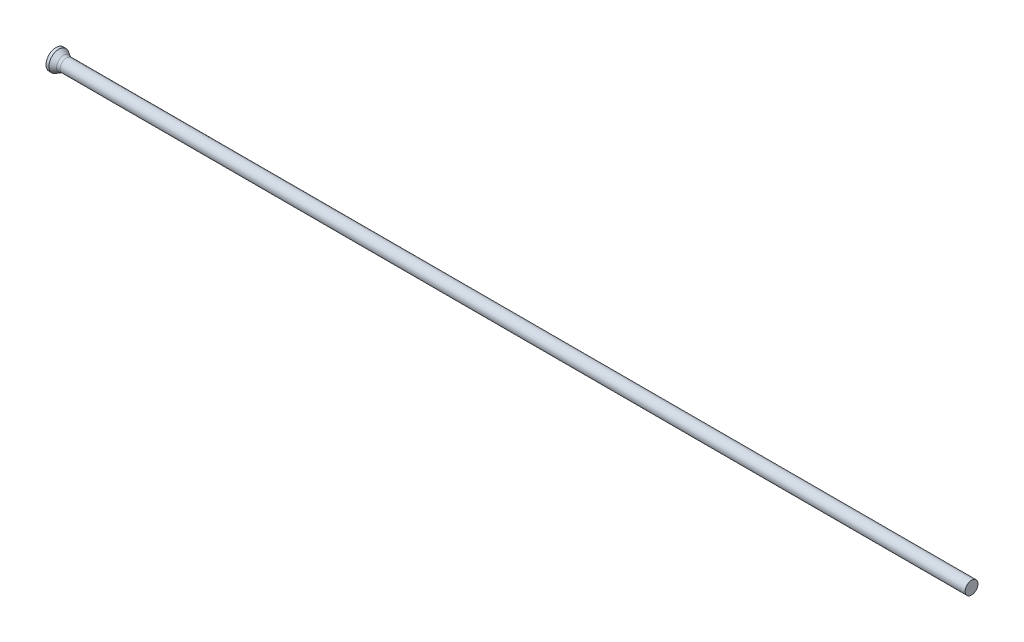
ISO-10303-21;
HEADER;
FILE_DESCRIPTION(('STEP AP214'),'2;1');
FILE_NAME('part.step','',(''),(''),'','','');
FILE_SCHEMA(('AUTOMOTIVE_DESIGN { 1 0 10303 214 1 1 1 1 }'));
ENDSEC;
DATA;
#1=APPLICATION_CONTEXT('core data for automotive mechanical design processes');
#2=APPLICATION_PROTOCOL_DEFINITION('international standard','automotive_design',2000,#1);
#3=PRODUCT_CONTEXT('',#1,'mechanical');
#4=PRODUCT('Part','Part','',(#3));
#5=PRODUCT_RELATED_PRODUCT_CATEGORY('part','',(#4));
#6=PRODUCT_DEFINITION_FORMATION('','',#4);
#7=PRODUCT_DEFINITION_CONTEXT('part definition',#1,'design');
#8=PRODUCT_DEFINITION('design','',#6,#7);
#9=PRODUCT_DEFINITION_SHAPE('','',#8);
#10=(LENGTH_UNIT() NAMED_UNIT(*) SI_UNIT(.MILLI.,.METRE.));
#11=(NAMED_UNIT(*) PLANE_ANGLE_UNIT() SI_UNIT($,.RADIAN.));
#12=(NAMED_UNIT(*) SI_UNIT($,.STERADIAN.) SOLID_ANGLE_UNIT());
#13=UNCERTAINTY_MEASURE_WITH_UNIT(LENGTH_MEASURE(1.E-05),#10,'distance_accuracy_value','');
#14=(GEOMETRIC_REPRESENTATION_CONTEXT(3) GLOBAL_UNCERTAINTY_ASSIGNED_CONTEXT((#13)) GLOBAL_UNIT_ASSIGNED_CONTEXT((#10,
#11,#12)) REPRESENTATION_CONTEXT('',''));
#15=CARTESIAN_POINT('',(0.,0.,0.));
#16=DIRECTION('',(0.,0.,1.));
#17=DIRECTION('',(1.,0.,0.));
#18=AXIS2_PLACEMENT_3D('',#15,#16,#17);
#19=CARTESIAN_POINT('',(0.,0.,0.));
#20=DIRECTION('',(1.,0.,0.));
#21=DIRECTION('',(0.,0.,-1.));
#22=AXIS2_PLACEMENT_3D('',#19,#20,#21);
#23=PLANE('',#22);
#24=CARTESIAN_POINT('',(0.,0.,0.));
#25=DIRECTION('',(-1.,0.,0.));
#26=DIRECTION('',(0.,0.,1.));
#27=AXIS2_PLACEMENT_3D('',#24,#25,#26);
#28=CIRCLE('',#27,1.75);
#29=CARTESIAN_POINT('',(0.,0.,1.75));
#30=VERTEX_POINT('',#29);
#31=EDGE_CURVE('E25',#30,#30,#28,.T.);
#32=ORIENTED_EDGE('',*,*,#31,.T.);
#33=EDGE_LOOP('',(#32));
#34=FACE_BOUND('',#33,.T.);
#35=ADVANCED_FACE('F14',(#34),#23,.F.);
#36=CARTESIAN_POINT('',(0.,0.,0.));
#37=DIRECTION('',(-1.,0.,0.));
#38=DIRECTION('',(0.,0.,1.));
#39=AXIS2_PLACEMENT_3D('',#36,#37,#38);
#40=CYLINDRICAL_SURFACE('',#39,1.75);
#41=ORIENTED_EDGE('',*,*,#31,.F.);
#42=EDGE_LOOP('',(#41));
#43=FACE_BOUND('',#42,.T.);
#44=CARTESIAN_POINT('',(0.507468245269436,0.,0.));
#45=DIRECTION('',(-1.,0.,0.));
#46=DIRECTION('',(0.,0.,1.));
#47=AXIS2_PLACEMENT_3D('',#44,#45,#46);
#48=CIRCLE('',#47,1.75);
#49=CARTESIAN_POINT('',(0.507468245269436,0.,1.75));
#50=VERTEX_POINT('',#49);
#51=EDGE_CURVE('E29',#50,#50,#48,.T.);
#52=ORIENTED_EDGE('',*,*,#51,.T.);
#53=EDGE_LOOP('',(#52));
#54=FACE_BOUND('',#53,.T.);
#55=ADVANCED_FACE('F53',(#43,#54),#40,.T.);
#56=CARTESIAN_POINT('',(1.59,0.,0.));
#57=DIRECTION('',(-1.,0.,0.));
#58=DIRECTION('',(0.,0.,1.));
#59=AXIS2_PLACEMENT_3D('',#56,#57,#58);
#60=CONICAL_SURFACE('',#59,1.125,0.523598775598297);
#61=CARTESIAN_POINT('',(1.35794919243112,0.,0.));
#62=DIRECTION('',(-1.,0.,0.));
#63=DIRECTION('',(0.,0.,1.));
#64=AXIS2_PLACEMENT_3D('',#61,#62,#63);
#65=CIRCLE('',#64,1.25897459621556);
#66=CARTESIAN_POINT('',(1.35794919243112,0.,1.25897459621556));
#67=VERTEX_POINT('',#66);
#68=EDGE_CURVE('E21',#67,#67,#65,.T.);
#69=ORIENTED_EDGE('',*,*,#68,.T.);
#70=EDGE_LOOP('',(#69));
#71=FACE_BOUND('',#70,.T.);
#72=ORIENTED_EDGE('',*,*,#51,.F.);
#73=EDGE_LOOP('',(#72));
#74=FACE_BOUND('',#73,.T.);
#75=ADVANCED_FACE('F50',(#71,#74),#60,.T.);
#76=CARTESIAN_POINT('',(0.,0.,0.));
#77=DIRECTION('',(-1.,0.,0.));
#78=DIRECTION('',(0.,0.,1.));
#79=AXIS2_PLACEMENT_3D('',#76,#77,#78);
#80=CYLINDRICAL_SURFACE('',#79,1.125);
#81=CARTESIAN_POINT('',(1.85794919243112,0.,0.));
#82=DIRECTION('',(-1.,0.,0.));
#83=DIRECTION('',(0.,0.,1.));
#84=AXIS2_PLACEMENT_3D('',#81,#82,#83);
#85=CIRCLE('',#84,1.125);
#86=CARTESIAN_POINT('',(1.85794919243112,0.,1.125));
#87=VERTEX_POINT('',#86);
#88=EDGE_CURVE('E9',#87,#87,#85,.F.);
#89=ORIENTED_EDGE('',*,*,#88,.T.);
#90=EDGE_LOOP('',(#89));
#91=FACE_BOUND('',#90,.T.);
#92=CARTESIAN_POINT('',(160.,0.,0.));
#93=DIRECTION('',(-1.,0.,0.));
#94=DIRECTION('',(0.,0.,1.));
#95=AXIS2_PLACEMENT_3D('',#92,#93,#94);
#96=CIRCLE('',#95,1.125);
#97=CARTESIAN_POINT('',(160.,0.,1.125));
#98=VERTEX_POINT('',#97);
#99=EDGE_CURVE('E34',#98,#98,#96,.T.);
#100=ORIENTED_EDGE('',*,*,#99,.T.);
#101=EDGE_LOOP('',(#100));
#102=FACE_BOUND('',#101,.T.);
#103=ADVANCED_FACE('F38',(#91,#102),#80,.T.);
#104=CARTESIAN_POINT('',(160.,1.125,0.));
#105=DIRECTION('',(-1.,0.,0.));
#106=DIRECTION('',(0.,0.,1.));
#107=AXIS2_PLACEMENT_3D('',#104,#105,#106);
#108=PLANE('',#107);
#109=ORIENTED_EDGE('',*,*,#99,.F.);
#110=EDGE_LOOP('',(#109));
#111=FACE_BOUND('',#110,.T.);
#112=ADVANCED_FACE('F40',(#111),#108,.F.);
#113=CARTESIAN_POINT('',(1.85794919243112,0.,0.));
#114=DIRECTION('',(-1.,0.,0.));
#115=DIRECTION('',(0.,0.,1.));
#116=AXIS2_PLACEMENT_3D('',#113,#114,#115);
#117=TOROIDAL_SURFACE('',#116,2.125,1.);
#118=ORIENTED_EDGE('',*,*,#88,.F.);
#119=EDGE_LOOP('',(#118));
#120=FACE_BOUND('',#119,.T.);
#121=ORIENTED_EDGE('',*,*,#68,.F.);
#122=EDGE_LOOP('',(#121));
#123=FACE_BOUND('',#122,.T.);
#124=ADVANCED_FACE('F16',(#120,#123),#117,.F.);
#125=CLOSED_SHELL('',(#35,#55,#75,#103,#112,#124));
#126=MANIFOLD_SOLID_BREP('B1',#125);
#127=ADVANCED_BREP_SHAPE_REPRESENTATION('',(#18,#126),#14);
#128=SHAPE_DEFINITION_REPRESENTATION(#9,#127);
ENDSEC;
END-ISO-10303-21;
